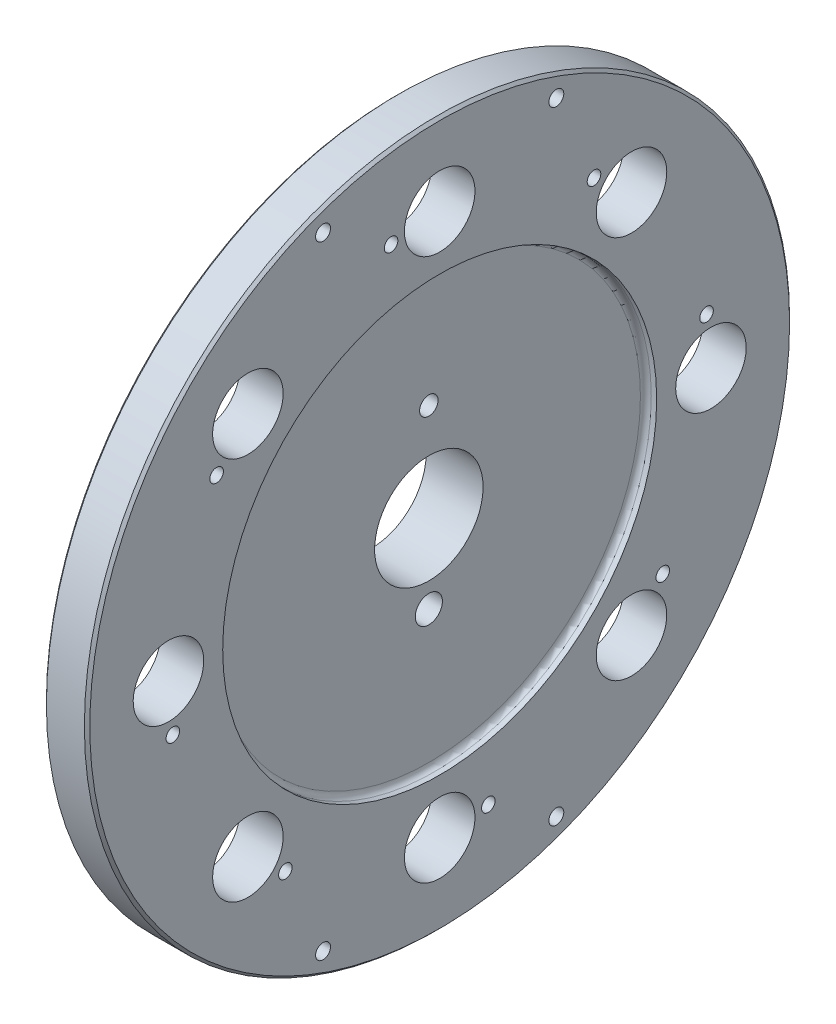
from build123d import *

# Parameters (mm, degrees)
SFAZOWANIE1_SIZE                           = 1
ZAOKR_GLENIE1_R                            = 1
ZAOKR_GLENIE2_R                            = 2
OTW_R_10_0_10_1_D                          = 10
SFAZOWANIE2_SIZE                           = 1
OTW_R_GWINTOWANY_M81_D                     = 6.8
SZKIC6_R                                   = 13
WYTNIJ_WYCI_GNI_CIE1_DEPTH                 = 186.539753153
SZYK_KO_OWY1_COUNT                         = 8
OTW_R_GWINTOWANY_M61_D                     = 5
SZYK_KO_OWY2_COUNT                         = 8
POG_BIENIE_STO_KOWE_POD_M5_WKR_T_Z_2_COUNT = 2
POG_BIENIE_STO_KOWE_POD_M5_WKR_T_Z_2_PITCH = 86
POG_BIENIE_STO_KOWE_POD_M5_WKR_T_Z_3_COUNT = 2
POG_BIENIE_STO_KOWE_POD_M5_WKR_T_Z_3_PITCH = 229.410113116
POG_BIENIE_STO_KOWE_POD_M5_WKR_T_Z_4_COUNT = 2
POG_BIENIE_STO_KOWE_POD_M5_WKR_T_Z_4_PITCH = 245


with BuildPart() as part:
    # Szkic1 → Obr_t1 (revolve)
    with BuildSketch(Plane.XY, mode=Mode.PRIVATE) as obr_t1_sk:
        Polygon((14.976890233, 130), (-1.023109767, 130), (-1.023109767, 60), (-10.023109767, 60), (-10.023109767, 20), (10.976890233, 20), (10.976890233, 80), (14.976890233, 80), align=None)
    revolve(obr_t1_sk.sketch.rotate(Axis((0, 0, 0), (-1, 0, 0)), 90), axis=Axis((0, 0, 0), (-1, 0, 0)))

    # Sfazowanie1
    sfazowanie1_edges = [part.edges().sort_by_distance(p)[0] for p in [
        (-10.023109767, 0, 60),
        (-1.023109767, 0, 130),
        (14.976890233, 0, 130),
    ]]
    chamfer(sfazowanie1_edges, length=SFAZOWANIE1_SIZE)

    # Zaokr_glenie1
    zaokr_glenie1_edges = [part.edges().sort_by_distance(p)[0] for p in [
        (-1.023109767, 0, 60),
    ]]
    fillet(zaokr_glenie1_edges, radius=ZAOKR_GLENIE1_R)

    # Zaokr_glenie2
    zaokr_glenie2_edges = [part.edges().sort_by_distance(p)[0] for p in [
        (10.976890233, 0, 80),
    ]]
    fillet(zaokr_glenie2_edges, radius=ZAOKR_GLENIE2_R)

    # Otw_r _10.0 _10_1 (through all)
    with Locations(Plane(origin=(10.976890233, -29, 0), x_dir=(0, 0, 1), z_dir=(1, 0, 0))):
        with Locations((0, 0)):
            Hole(OTW_R_10_0_10_1_D / 2)

    # Sfazowanie2
    sfazowanie2_edges = [part.edges().sort_by_distance(p)[0] for p in [
        (-10.023109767, -29, 5),
    ]]
    chamfer(sfazowanie2_edges, length=SFAZOWANIE2_SIZE)

    # Otw_r gwintowany M81 (through all)
    with Locations(Plane(origin=(10.976890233, 36, 0), x_dir=(0, 0, 1), z_dir=(1, 0, 0))):
        with Locations((0, 0)):
            Hole(OTW_R_GWINTOWANY_M81_D / 2)

    # Szkic6 → Wytnij-wyci_gni_cie1 (cut, through all)
    with BuildSketch(Plane(origin=(14.976890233, 0, 0), x_dir=(0, 0, -1), z_dir=(1, 0, 0))):
        with Locations((0, -100)):
            Circle(SZKIC6_R)
    wytnij_wyci_gni_cie1 = extrude(amount=-WYTNIJ_WYCI_GNI_CIE1_DEPTH, mode=Mode.SUBTRACT)

    # Szyk ko_owy1: Wytnij-wyci_gni_cie1 ×8 about axis
    szyk_ko_owy1_axis = Axis((0, 0, 0), (1, 0, 0))
    for i in range(1, SZYK_KO_OWY1_COUNT):
        add(wytnij_wyci_gni_cie1.rotate(szyk_ko_owy1_axis, i * 360 / SZYK_KO_OWY1_COUNT), mode=Mode.SUBTRACT)

    # Otw_r gwintowany M61 (through all)
    with Locations(Plane(origin=(14.976890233, -98.38, -17.926951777), x_dir=(0, 0, 1), z_dir=(1, 0, 0))):
        with Locations((0, 0)):
            otw_r_gwintowany_m61 = Hole(OTW_R_GWINTOWANY_M61_D / 2)

    # Szyk ko_owy2: Otw_r gwintowany M61 ×8 about axis
    szyk_ko_owy2_axis = Axis((0, 0, 0), (1, 0, 0))
    for i in range(1, SZYK_KO_OWY2_COUNT):
        add(otw_r_gwintowany_m61.rotate(szyk_ko_owy2_axis, i * 360 / SZYK_KO_OWY2_COUNT), mode=Mode.SUBTRACT)

    # Szkic10 → Pog_bienie sto_kowe pod M5 Wkr_t z _bem (revolve, cut)
    with BuildSketch(Plane(origin=(-1.023109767, 114.705056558, -43), x_dir=(0, 0, 1), z_dir=(0, 1, 0))):
        Polygon((0, 0), (0, 16), (2.75, 16), (2.75, 4.45), (5.2, 2), (5.2, 0), align=None)
    pog_bienie_sto_kowe_pod_m5_wkr_t_z_bem = revolve(axis=Axis((-7.373109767, 114.705056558, -43), (1, 0, 0)), mode=Mode.SUBTRACT)

    # Pog_bienie sto_kowe pod M5 Wkr_t z _ 2: Pog_bienie sto_kowe pod M5 Wkr_t z _bem ×2
    with Locations(*[(0, 0, i * POG_BIENIE_STO_KOWE_POD_M5_WKR_T_Z_2_PITCH) for i in range(1, POG_BIENIE_STO_KOWE_POD_M5_WKR_T_Z_2_COUNT)]):
        add(pog_bienie_sto_kowe_pod_m5_wkr_t_z_bem, mode=Mode.SUBTRACT)

    # Pog_bienie sto_kowe pod M5 Wkr_t z _ 3: Pog_bienie sto_kowe pod M5 Wkr_t z _bem ×2
    with Locations(*[(0, -i * POG_BIENIE_STO_KOWE_POD_M5_WKR_T_Z_3_PITCH, 0) for i in range(1, POG_BIENIE_STO_KOWE_POD_M5_WKR_T_Z_3_COUNT)]):
        add(pog_bienie_sto_kowe_pod_m5_wkr_t_z_bem, mode=Mode.SUBTRACT)

    # Pog_bienie sto_kowe pod M5 Wkr_t z _ 4: Pog_bienie sto_kowe pod M5 Wkr_t z _bem ×2
    with Locations(*[Vector(0, -0.9363678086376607, 0.35102040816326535) * (i * POG_BIENIE_STO_KOWE_POD_M5_WKR_T_Z_4_PITCH) for i in range(1, POG_BIENIE_STO_KOWE_POD_M5_WKR_T_Z_4_COUNT)]):
        add(pog_bienie_sto_kowe_pod_m5_wkr_t_z_bem, mode=Mode.SUBTRACT)


solid = part.part
